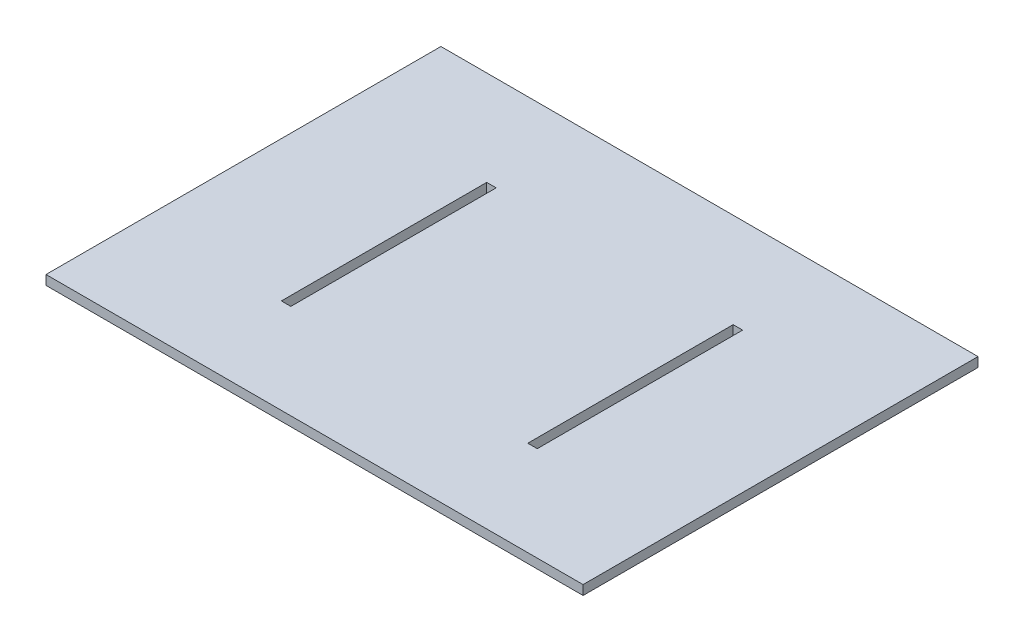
ISO-10303-21;
HEADER;
FILE_DESCRIPTION(('STEP AP214'),'2;1');
FILE_NAME('part.step','',(''),(''),'','','');
FILE_SCHEMA(('AUTOMOTIVE_DESIGN { 1 0 10303 214 1 1 1 1 }'));
ENDSEC;
DATA;
#1=APPLICATION_CONTEXT('core data for automotive mechanical design processes');
#2=APPLICATION_PROTOCOL_DEFINITION('international standard','automotive_design',2000,#1);
#3=PRODUCT_CONTEXT('',#1,'mechanical');
#4=PRODUCT('Part','Part','',(#3));
#5=PRODUCT_RELATED_PRODUCT_CATEGORY('part','',(#4));
#6=PRODUCT_DEFINITION_FORMATION('','',#4);
#7=PRODUCT_DEFINITION_CONTEXT('part definition',#1,'design');
#8=PRODUCT_DEFINITION('design','',#6,#7);
#9=PRODUCT_DEFINITION_SHAPE('','',#8);
#10=(LENGTH_UNIT() NAMED_UNIT(*) SI_UNIT(.MILLI.,.METRE.));
#11=(NAMED_UNIT(*) PLANE_ANGLE_UNIT() SI_UNIT($,.RADIAN.));
#12=(NAMED_UNIT(*) SI_UNIT($,.STERADIAN.) SOLID_ANGLE_UNIT());
#13=UNCERTAINTY_MEASURE_WITH_UNIT(LENGTH_MEASURE(1.E-05),#10,'distance_accuracy_value','');
#14=(GEOMETRIC_REPRESENTATION_CONTEXT(3) GLOBAL_UNCERTAINTY_ASSIGNED_CONTEXT((#13)) GLOBAL_UNIT_ASSIGNED_CONTEXT((#10,
#11,#12)) REPRESENTATION_CONTEXT('',''));
#15=CARTESIAN_POINT('',(0.,0.,0.));
#16=DIRECTION('',(0.,0.,1.));
#17=DIRECTION('',(1.,0.,0.));
#18=AXIS2_PLACEMENT_3D('',#15,#16,#17);
#19=CARTESIAN_POINT('',(0.,12.,0.));
#20=DIRECTION('',(1.,0.,0.));
#21=DIRECTION('',(0.,0.,-1.));
#22=AXIS2_PLACEMENT_3D('',#19,#20,#21);
#23=PLANE('',#22);
#24=DIRECTION('',(0.,0.,1.));
#25=VECTOR('',#24,1.);
#26=CARTESIAN_POINT('',(0.,0.,0.));
#27=LINE('',#26,#25);
#28=CARTESIAN_POINT('',(0.,0.,-500.));
#29=VERTEX_POINT('',#28);
#30=CARTESIAN_POINT('',(0.,0.,0.));
#31=VERTEX_POINT('',#30);
#32=EDGE_CURVE('E162',#29,#31,#27,.T.);
#33=ORIENTED_EDGE('',*,*,#32,.T.);
#34=DIRECTION('',(0.,-1.,0.));
#35=VECTOR('',#34,1.);
#36=CARTESIAN_POINT('',(0.,12.,0.));
#37=LINE('',#36,#35);
#38=CARTESIAN_POINT('',(0.,12.,0.));
#39=VERTEX_POINT('',#38);
#40=EDGE_CURVE('E195',#39,#31,#37,.T.);
#41=ORIENTED_EDGE('',*,*,#40,.F.);
#42=DIRECTION('',(0.,0.,1.));
#43=VECTOR('',#42,1.);
#44=CARTESIAN_POINT('',(0.,12.,0.));
#45=LINE('',#44,#43);
#46=CARTESIAN_POINT('',(0.,12.,-500.));
#47=VERTEX_POINT('',#46);
#48=EDGE_CURVE('E169',#47,#39,#45,.T.);
#49=ORIENTED_EDGE('',*,*,#48,.F.);
#50=DIRECTION('',(0.,-1.,0.));
#51=VECTOR('',#50,1.);
#52=CARTESIAN_POINT('',(0.,12.,-500.));
#53=LINE('',#52,#51);
#54=EDGE_CURVE('E179',#47,#29,#53,.T.);
#55=ORIENTED_EDGE('',*,*,#54,.T.);
#56=EDGE_LOOP('',(#33,#41,#49,#55));
#57=FACE_BOUND('',#56,.T.);
#58=ADVANCED_FACE('F33',(#57),#23,.F.);
#59=CARTESIAN_POINT('',(0.,12.,0.));
#60=DIRECTION('',(0.,0.,-1.));
#61=DIRECTION('',(-1.,0.,0.));
#62=AXIS2_PLACEMENT_3D('',#59,#60,#61);
#63=PLANE('',#62);
#64=DIRECTION('',(1.,0.,0.));
#65=VECTOR('',#64,1.);
#66=CARTESIAN_POINT('',(0.,0.,0.));
#67=LINE('',#66,#65);
#68=CARTESIAN_POINT('',(680.,0.,0.));
#69=VERTEX_POINT('',#68);
#70=EDGE_CURVE('E182',#31,#69,#67,.T.);
#71=ORIENTED_EDGE('',*,*,#70,.T.);
#72=DIRECTION('',(0.,-1.,0.));
#73=VECTOR('',#72,1.);
#74=CARTESIAN_POINT('',(680.,12.,0.));
#75=LINE('',#74,#73);
#76=CARTESIAN_POINT('',(680.,12.,0.));
#77=VERTEX_POINT('',#76);
#78=EDGE_CURVE('E192',#77,#69,#75,.T.);
#79=ORIENTED_EDGE('',*,*,#78,.F.);
#80=DIRECTION('',(1.,0.,0.));
#81=VECTOR('',#80,1.);
#82=CARTESIAN_POINT('',(0.,12.,0.));
#83=LINE('',#82,#81);
#84=EDGE_CURVE('E172',#39,#77,#83,.T.);
#85=ORIENTED_EDGE('',*,*,#84,.F.);
#86=ORIENTED_EDGE('',*,*,#40,.T.);
#87=EDGE_LOOP('',(#71,#79,#85,#86));
#88=FACE_BOUND('',#87,.T.);
#89=ADVANCED_FACE('F232',(#88),#63,.F.);
#90=CARTESIAN_POINT('',(680.,12.,0.));
#91=DIRECTION('',(-1.,0.,0.));
#92=DIRECTION('',(0.,0.,1.));
#93=AXIS2_PLACEMENT_3D('',#90,#91,#92);
#94=PLANE('',#93);
#95=DIRECTION('',(0.,0.,-1.));
#96=VECTOR('',#95,1.);
#97=CARTESIAN_POINT('',(680.,0.,0.));
#98=LINE('',#97,#96);
#99=CARTESIAN_POINT('',(680.,0.,-500.));
#100=VERTEX_POINT('',#99);
#101=EDGE_CURVE('E184',#69,#100,#98,.T.);
#102=ORIENTED_EDGE('',*,*,#101,.T.);
#103=DIRECTION('',(0.,-1.,0.));
#104=VECTOR('',#103,1.);
#105=CARTESIAN_POINT('',(680.,12.,-500.));
#106=LINE('',#105,#104);
#107=CARTESIAN_POINT('',(680.,12.,-500.));
#108=VERTEX_POINT('',#107);
#109=EDGE_CURVE('E189',#108,#100,#106,.T.);
#110=ORIENTED_EDGE('',*,*,#109,.F.);
#111=DIRECTION('',(0.,0.,-1.));
#112=VECTOR('',#111,1.);
#113=CARTESIAN_POINT('',(680.,12.,0.));
#114=LINE('',#113,#112);
#115=EDGE_CURVE('E175',#77,#108,#114,.T.);
#116=ORIENTED_EDGE('',*,*,#115,.F.);
#117=ORIENTED_EDGE('',*,*,#78,.T.);
#118=EDGE_LOOP('',(#102,#110,#116,#117));
#119=FACE_BOUND('',#118,.T.);
#120=ADVANCED_FACE('F237',(#119),#94,.F.);
#121=CARTESIAN_POINT('',(0.,12.,-500.));
#122=DIRECTION('',(0.,0.,1.));
#123=DIRECTION('',(1.,0.,0.));
#124=AXIS2_PLACEMENT_3D('',#121,#122,#123);
#125=PLANE('',#124);
#126=DIRECTION('',(-1.,0.,0.));
#127=VECTOR('',#126,1.);
#128=CARTESIAN_POINT('',(0.,0.,-500.));
#129=LINE('',#128,#127);
#130=EDGE_CURVE('E173',#100,#29,#129,.T.);
#131=ORIENTED_EDGE('',*,*,#130,.T.);
#132=ORIENTED_EDGE('',*,*,#54,.F.);
#133=DIRECTION('',(-1.,0.,0.));
#134=VECTOR('',#133,1.);
#135=CARTESIAN_POINT('',(0.,12.,-500.));
#136=LINE('',#135,#134);
#137=EDGE_CURVE('E177',#108,#47,#136,.T.);
#138=ORIENTED_EDGE('',*,*,#137,.F.);
#139=ORIENTED_EDGE('',*,*,#109,.T.);
#140=EDGE_LOOP('',(#131,#132,#138,#139));
#141=FACE_BOUND('',#140,.T.);
#142=ADVANCED_FACE('F252',(#141),#125,.F.);
#143=CARTESIAN_POINT('',(0.,12.,0.));
#144=DIRECTION('',(0.,-1.,0.));
#145=DIRECTION('',(0.,0.,-1.));
#146=AXIS2_PLACEMENT_3D('',#143,#144,#145);
#147=PLANE('',#146);
#148=DIRECTION('',(1.,0.,0.));
#149=VECTOR('',#148,1.);
#150=CARTESIAN_POINT('',(490.,12.,-120.));
#151=LINE('',#150,#149);
#152=CARTESIAN_POINT('',(490.,12.,-120.));
#153=VERTEX_POINT('',#152);
#154=CARTESIAN_POINT('',(502.,12.,-120.));
#155=VERTEX_POINT('',#154);
#156=EDGE_CURVE('E132',#153,#155,#151,.T.);
#157=ORIENTED_EDGE('',*,*,#156,.F.);
#158=DIRECTION('',(0.,0.,1.));
#159=VECTOR('',#158,1.);
#160=CARTESIAN_POINT('',(490.,12.,-380.));
#161=LINE('',#160,#159);
#162=CARTESIAN_POINT('',(490.,12.,-380.));
#163=VERTEX_POINT('',#162);
#164=EDGE_CURVE('E47',#163,#153,#161,.T.);
#165=ORIENTED_EDGE('',*,*,#164,.F.);
#166=DIRECTION('',(-1.,0.,0.));
#167=VECTOR('',#166,1.);
#168=CARTESIAN_POINT('',(490.,12.,-380.));
#169=LINE('',#168,#167);
#170=CARTESIAN_POINT('',(502.,12.,-380.));
#171=VERTEX_POINT('',#170);
#172=EDGE_CURVE('E139',#171,#163,#169,.T.);
#173=ORIENTED_EDGE('',*,*,#172,.F.);
#174=DIRECTION('',(0.,0.,-1.));
#175=VECTOR('',#174,1.);
#176=CARTESIAN_POINT('',(502.,12.,-380.));
#177=LINE('',#176,#175);
#178=EDGE_CURVE('E123',#155,#171,#177,.T.);
#179=ORIENTED_EDGE('',*,*,#178,.F.);
#180=EDGE_LOOP('',(#157,#165,#173,#179));
#181=FACE_BOUND('',#180,.T.);
#182=DIRECTION('',(1.,0.,0.));
#183=VECTOR('',#182,1.);
#184=CARTESIAN_POINT('',(178.,12.,-120.));
#185=LINE('',#184,#183);
#186=CARTESIAN_POINT('',(178.,12.,-120.));
#187=VERTEX_POINT('',#186);
#188=CARTESIAN_POINT('',(190.,12.,-120.));
#189=VERTEX_POINT('',#188);
#190=EDGE_CURVE('E150',#187,#189,#185,.T.);
#191=ORIENTED_EDGE('',*,*,#190,.F.);
#192=DIRECTION('',(0.,0.,1.));
#193=VECTOR('',#192,1.);
#194=CARTESIAN_POINT('',(178.,12.,-380.));
#195=LINE('',#194,#193);
#196=CARTESIAN_POINT('',(178.,12.,-380.));
#197=VERTEX_POINT('',#196);
#198=EDGE_CURVE('E146',#197,#187,#195,.T.);
#199=ORIENTED_EDGE('',*,*,#198,.F.);
#200=DIRECTION('',(-1.,0.,0.));
#201=VECTOR('',#200,1.);
#202=CARTESIAN_POINT('',(178.,12.,-380.));
#203=LINE('',#202,#201);
#204=CARTESIAN_POINT('',(190.,12.,-380.));
#205=VERTEX_POINT('',#204);
#206=EDGE_CURVE('E156',#205,#197,#203,.T.);
#207=ORIENTED_EDGE('',*,*,#206,.F.);
#208=DIRECTION('',(0.,0.,-1.));
#209=VECTOR('',#208,1.);
#210=CARTESIAN_POINT('',(190.,12.,-380.));
#211=LINE('',#210,#209);
#212=EDGE_CURVE('E153',#189,#205,#211,.T.);
#213=ORIENTED_EDGE('',*,*,#212,.F.);
#214=EDGE_LOOP('',(#191,#199,#207,#213));
#215=FACE_BOUND('',#214,.T.);
#216=ORIENTED_EDGE('',*,*,#48,.T.);
#217=ORIENTED_EDGE('',*,*,#84,.T.);
#218=ORIENTED_EDGE('',*,*,#115,.T.);
#219=ORIENTED_EDGE('',*,*,#137,.T.);
#220=EDGE_LOOP('',(#216,#217,#218,#219));
#221=FACE_BOUND('',#220,.T.);
#222=ADVANCED_FACE('F136',(#181,#215,#221),#147,.F.);
#223=CARTESIAN_POINT('',(0.,0.,0.));
#224=DIRECTION('',(0.,-1.,0.));
#225=DIRECTION('',(0.,0.,-1.));
#226=AXIS2_PLACEMENT_3D('',#223,#224,#225);
#227=PLANE('',#226);
#228=DIRECTION('',(0.,0.,-1.));
#229=VECTOR('',#228,1.);
#230=CARTESIAN_POINT('',(490.,0.,0.));
#231=LINE('',#230,#229);
#232=CARTESIAN_POINT('',(490.,0.,-120.));
#233=VERTEX_POINT('',#232);
#234=CARTESIAN_POINT('',(490.,0.,-380.));
#235=VERTEX_POINT('',#234);
#236=EDGE_CURVE('E11',#233,#235,#231,.T.);
#237=ORIENTED_EDGE('',*,*,#236,.F.);
#238=DIRECTION('',(-1.,0.,0.));
#239=VECTOR('',#238,1.);
#240=CARTESIAN_POINT('',(-1.38777878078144E-13,0.,-119.999999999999));
#241=LINE('',#240,#239);
#242=CARTESIAN_POINT('',(502.,0.,-120.));
#243=VERTEX_POINT('',#242);
#244=EDGE_CURVE('E207',#243,#233,#241,.T.);
#245=ORIENTED_EDGE('',*,*,#244,.F.);
#246=DIRECTION('',(0.,0.,1.));
#247=VECTOR('',#246,1.);
#248=CARTESIAN_POINT('',(502.,0.,0.));
#249=LINE('',#248,#247);
#250=CARTESIAN_POINT('',(502.,0.,-380.));
#251=VERTEX_POINT('',#250);
#252=EDGE_CURVE('E126',#251,#243,#249,.T.);
#253=ORIENTED_EDGE('',*,*,#252,.F.);
#254=DIRECTION('',(1.,0.,0.));
#255=VECTOR('',#254,1.);
#256=CARTESIAN_POINT('',(0.,0.,-380.));
#257=LINE('',#256,#255);
#258=EDGE_CURVE('E40',#235,#251,#257,.T.);
#259=ORIENTED_EDGE('',*,*,#258,.F.);
#260=EDGE_LOOP('',(#237,#245,#253,#259));
#261=FACE_BOUND('',#260,.T.);
#262=DIRECTION('',(0.,0.,-1.));
#263=VECTOR('',#262,1.);
#264=CARTESIAN_POINT('',(178.,0.,0.));
#265=LINE('',#264,#263);
#266=CARTESIAN_POINT('',(178.,0.,-120.));
#267=VERTEX_POINT('',#266);
#268=CARTESIAN_POINT('',(178.,0.,-380.));
#269=VERTEX_POINT('',#268);
#270=EDGE_CURVE('E205',#267,#269,#265,.T.);
#271=ORIENTED_EDGE('',*,*,#270,.F.);
#272=DIRECTION('',(-1.,0.,0.));
#273=VECTOR('',#272,1.);
#274=CARTESIAN_POINT('',(0.,0.,-120.));
#275=LINE('',#274,#273);
#276=CARTESIAN_POINT('',(190.,0.,-120.));
#277=VERTEX_POINT('',#276);
#278=EDGE_CURVE('E198',#277,#267,#275,.T.);
#279=ORIENTED_EDGE('',*,*,#278,.F.);
#280=DIRECTION('',(0.,0.,1.));
#281=VECTOR('',#280,1.);
#282=CARTESIAN_POINT('',(190.,0.,0.));
#283=LINE('',#282,#281);
#284=CARTESIAN_POINT('',(190.,0.,-380.));
#285=VERTEX_POINT('',#284);
#286=EDGE_CURVE('E200',#285,#277,#283,.T.);
#287=ORIENTED_EDGE('',*,*,#286,.F.);
#288=DIRECTION('',(1.,0.,0.));
#289=VECTOR('',#288,1.);
#290=CARTESIAN_POINT('',(0.,0.,-380.));
#291=LINE('',#290,#289);
#292=EDGE_CURVE('E203',#269,#285,#291,.T.);
#293=ORIENTED_EDGE('',*,*,#292,.F.);
#294=EDGE_LOOP('',(#271,#279,#287,#293));
#295=FACE_BOUND('',#294,.T.);
#296=ORIENTED_EDGE('',*,*,#32,.F.);
#297=ORIENTED_EDGE('',*,*,#130,.F.);
#298=ORIENTED_EDGE('',*,*,#101,.F.);
#299=ORIENTED_EDGE('',*,*,#70,.F.);
#300=EDGE_LOOP('',(#296,#297,#298,#299));
#301=FACE_BOUND('',#300,.T.);
#302=ADVANCED_FACE('F215',(#261,#295,#301),#227,.T.);
#303=CARTESIAN_POINT('',(178.,-2.,-380.));
#304=DIRECTION('',(-1.,0.,0.));
#305=DIRECTION('',(0.,0.,1.));
#306=AXIS2_PLACEMENT_3D('',#303,#304,#305);
#307=PLANE('',#306);
#308=ORIENTED_EDGE('',*,*,#270,.T.);
#309=DIRECTION('',(0.,1.,0.));
#310=VECTOR('',#309,1.);
#311=CARTESIAN_POINT('',(178.,-2.,-380.));
#312=LINE('',#311,#310);
#313=EDGE_CURVE('E160',#269,#197,#312,.T.);
#314=ORIENTED_EDGE('',*,*,#313,.T.);
#315=ORIENTED_EDGE('',*,*,#198,.T.);
#316=DIRECTION('',(0.,1.,0.));
#317=VECTOR('',#316,1.);
#318=CARTESIAN_POINT('',(178.,-2.,-120.));
#319=LINE('',#318,#317);
#320=EDGE_CURVE('E159',#267,#187,#319,.T.);
#321=ORIENTED_EDGE('',*,*,#320,.F.);
#322=EDGE_LOOP('',(#308,#314,#315,#321));
#323=FACE_BOUND('',#322,.T.);
#324=ADVANCED_FACE('F263',(#323),#307,.F.);
#325=CARTESIAN_POINT('',(178.,-2.,-380.));
#326=DIRECTION('',(0.,0.,-1.));
#327=DIRECTION('',(-1.,0.,0.));
#328=AXIS2_PLACEMENT_3D('',#325,#326,#327);
#329=PLANE('',#328);
#330=ORIENTED_EDGE('',*,*,#292,.T.);
#331=DIRECTION('',(0.,1.,0.));
#332=VECTOR('',#331,1.);
#333=CARTESIAN_POINT('',(190.,-2.,-380.));
#334=LINE('',#333,#332);
#335=EDGE_CURVE('E163',#285,#205,#334,.T.);
#336=ORIENTED_EDGE('',*,*,#335,.T.);
#337=ORIENTED_EDGE('',*,*,#206,.T.);
#338=ORIENTED_EDGE('',*,*,#313,.F.);
#339=EDGE_LOOP('',(#330,#336,#337,#338));
#340=FACE_BOUND('',#339,.T.);
#341=ADVANCED_FACE('F267',(#340),#329,.F.);
#342=CARTESIAN_POINT('',(190.,-2.,-380.));
#343=DIRECTION('',(1.,0.,0.));
#344=DIRECTION('',(0.,0.,-1.));
#345=AXIS2_PLACEMENT_3D('',#342,#343,#344);
#346=PLANE('',#345);
#347=ORIENTED_EDGE('',*,*,#286,.T.);
#348=DIRECTION('',(0.,1.,0.));
#349=VECTOR('',#348,1.);
#350=CARTESIAN_POINT('',(190.,-2.,-120.));
#351=LINE('',#350,#349);
#352=EDGE_CURVE('E165',#277,#189,#351,.T.);
#353=ORIENTED_EDGE('',*,*,#352,.T.);
#354=ORIENTED_EDGE('',*,*,#212,.T.);
#355=ORIENTED_EDGE('',*,*,#335,.F.);
#356=EDGE_LOOP('',(#347,#353,#354,#355));
#357=FACE_BOUND('',#356,.T.);
#358=ADVANCED_FACE('F226',(#357),#346,.F.);
#359=CARTESIAN_POINT('',(178.,-2.,-120.));
#360=DIRECTION('',(0.,0.,1.));
#361=DIRECTION('',(1.,0.,0.));
#362=AXIS2_PLACEMENT_3D('',#359,#360,#361);
#363=PLANE('',#362);
#364=ORIENTED_EDGE('',*,*,#278,.T.);
#365=ORIENTED_EDGE('',*,*,#320,.T.);
#366=ORIENTED_EDGE('',*,*,#190,.T.);
#367=ORIENTED_EDGE('',*,*,#352,.F.);
#368=EDGE_LOOP('',(#364,#365,#366,#367));
#369=FACE_BOUND('',#368,.T.);
#370=ADVANCED_FACE('F219',(#369),#363,.F.);
#371=CARTESIAN_POINT('',(490.,-2.,-380.));
#372=DIRECTION('',(-1.,0.,0.));
#373=DIRECTION('',(0.,0.,1.));
#374=AXIS2_PLACEMENT_3D('',#371,#372,#373);
#375=PLANE('',#374);
#376=ORIENTED_EDGE('',*,*,#236,.T.);
#377=DIRECTION('',(0.,1.,0.));
#378=VECTOR('',#377,1.);
#379=CARTESIAN_POINT('',(490.,-2.,-380.));
#380=LINE('',#379,#378);
#381=EDGE_CURVE('E144',#235,#163,#380,.T.);
#382=ORIENTED_EDGE('',*,*,#381,.T.);
#383=ORIENTED_EDGE('',*,*,#164,.T.);
#384=DIRECTION('',(0.,1.,0.));
#385=VECTOR('',#384,1.);
#386=CARTESIAN_POINT('',(490.,-2.,-120.));
#387=LINE('',#386,#385);
#388=EDGE_CURVE('E129',#233,#153,#387,.T.);
#389=ORIENTED_EDGE('',*,*,#388,.F.);
#390=EDGE_LOOP('',(#376,#382,#383,#389));
#391=FACE_BOUND('',#390,.T.);
#392=ADVANCED_FACE('F217',(#391),#375,.F.);
#393=CARTESIAN_POINT('',(490.,-2.,-380.));
#394=DIRECTION('',(0.,0.,-1.));
#395=DIRECTION('',(-1.,0.,0.));
#396=AXIS2_PLACEMENT_3D('',#393,#394,#395);
#397=PLANE('',#396);
#398=ORIENTED_EDGE('',*,*,#258,.T.);
#399=DIRECTION('',(0.,1.,0.));
#400=VECTOR('',#399,1.);
#401=CARTESIAN_POINT('',(502.,-2.,-380.));
#402=LINE('',#401,#400);
#403=EDGE_CURVE('E128',#251,#171,#402,.T.);
#404=ORIENTED_EDGE('',*,*,#403,.T.);
#405=ORIENTED_EDGE('',*,*,#172,.T.);
#406=ORIENTED_EDGE('',*,*,#381,.F.);
#407=EDGE_LOOP('',(#398,#404,#405,#406));
#408=FACE_BOUND('',#407,.T.);
#409=ADVANCED_FACE('F212',(#408),#397,.F.);
#410=CARTESIAN_POINT('',(502.,-2.,-380.));
#411=DIRECTION('',(1.,0.,0.));
#412=DIRECTION('',(0.,0.,-1.));
#413=AXIS2_PLACEMENT_3D('',#410,#411,#412);
#414=PLANE('',#413);
#415=ORIENTED_EDGE('',*,*,#252,.T.);
#416=DIRECTION('',(0.,1.,0.));
#417=VECTOR('',#416,1.);
#418=CARTESIAN_POINT('',(502.,-2.,-120.));
#419=LINE('',#418,#417);
#420=EDGE_CURVE('E55',#243,#155,#419,.T.);
#421=ORIENTED_EDGE('',*,*,#420,.T.);
#422=ORIENTED_EDGE('',*,*,#178,.T.);
#423=ORIENTED_EDGE('',*,*,#403,.F.);
#424=EDGE_LOOP('',(#415,#421,#422,#423));
#425=FACE_BOUND('',#424,.T.);
#426=ADVANCED_FACE('F120',(#425),#414,.F.);
#427=CARTESIAN_POINT('',(490.,-2.,-120.));
#428=DIRECTION('',(0.,0.,1.));
#429=DIRECTION('',(1.,0.,0.));
#430=AXIS2_PLACEMENT_3D('',#427,#428,#429);
#431=PLANE('',#430);
#432=ORIENTED_EDGE('',*,*,#244,.T.);
#433=ORIENTED_EDGE('',*,*,#388,.T.);
#434=ORIENTED_EDGE('',*,*,#156,.T.);
#435=ORIENTED_EDGE('',*,*,#420,.F.);
#436=EDGE_LOOP('',(#432,#433,#434,#435));
#437=FACE_BOUND('',#436,.T.);
#438=ADVANCED_FACE('F133',(#437),#431,.F.);
#439=CLOSED_SHELL('',(#58,#89,#120,#142,#222,#302,#324,#341,#358,#370,#392,#409,#426,#438));
#440=MANIFOLD_SOLID_BREP('B2',#439);
#441=ADVANCED_BREP_SHAPE_REPRESENTATION('',(#18,#440),#14);
#442=SHAPE_DEFINITION_REPRESENTATION(#9,#441);
ENDSEC;
END-ISO-10303-21;
